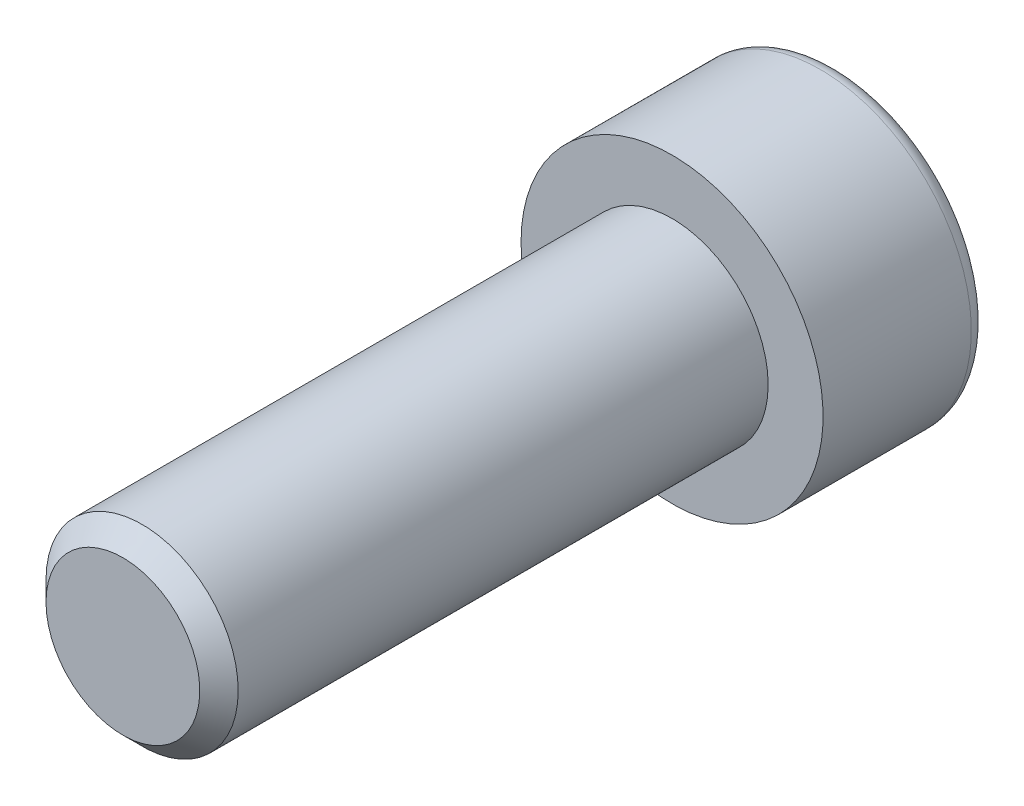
ISO-10303-21;
HEADER;
FILE_DESCRIPTION(('STEP AP214'),'2;1');
FILE_NAME('part.step','',(''),(''),'','','');
FILE_SCHEMA(('AUTOMOTIVE_DESIGN { 1 0 10303 214 1 1 1 1 }'));
ENDSEC;
DATA;
#1=APPLICATION_CONTEXT('core data for automotive mechanical design processes');
#2=APPLICATION_PROTOCOL_DEFINITION('international standard','automotive_design',2000,#1);
#3=PRODUCT_CONTEXT('',#1,'mechanical');
#4=PRODUCT('Part','Part','',(#3));
#5=PRODUCT_RELATED_PRODUCT_CATEGORY('part','',(#4));
#6=PRODUCT_DEFINITION_FORMATION('','',#4);
#7=PRODUCT_DEFINITION_CONTEXT('part definition',#1,'design');
#8=PRODUCT_DEFINITION('design','',#6,#7);
#9=PRODUCT_DEFINITION_SHAPE('','',#8);
#10=(LENGTH_UNIT() NAMED_UNIT(*) SI_UNIT(.MILLI.,.METRE.));
#11=(NAMED_UNIT(*) PLANE_ANGLE_UNIT() SI_UNIT($,.RADIAN.));
#12=(NAMED_UNIT(*) SI_UNIT($,.STERADIAN.) SOLID_ANGLE_UNIT());
#13=UNCERTAINTY_MEASURE_WITH_UNIT(LENGTH_MEASURE(1.E-05),#10,'distance_accuracy_value','');
#14=(GEOMETRIC_REPRESENTATION_CONTEXT(3) GLOBAL_UNCERTAINTY_ASSIGNED_CONTEXT((#13)) GLOBAL_UNIT_ASSIGNED_CONTEXT((#10,
#11,#12)) REPRESENTATION_CONTEXT('',''));
#15=CARTESIAN_POINT('',(0.,0.,0.));
#16=DIRECTION('',(0.,0.,1.));
#17=DIRECTION('',(1.,0.,0.));
#18=AXIS2_PLACEMENT_3D('',#15,#16,#17);
#19=CARTESIAN_POINT('',(0.,0.,-3.));
#20=DIRECTION('',(0.,0.,1.));
#21=DIRECTION('',(1.,0.,0.));
#22=AXIS2_PLACEMENT_3D('',#19,#20,#21);
#23=PLANE('',#22);
#24=CARTESIAN_POINT('',(0.,0.,-3.));
#25=DIRECTION('',(0.,0.,-1.));
#26=DIRECTION('',(-1.,0.,0.));
#27=AXIS2_PLACEMENT_3D('',#24,#25,#26);
#28=CIRCLE('',#27,2.45);
#29=CARTESIAN_POINT('',(-2.45,0.,-3.));
#30=VERTEX_POINT('',#29);
#31=EDGE_CURVE('E142',#30,#30,#28,.T.);
#32=ORIENTED_EDGE('',*,*,#31,.T.);
#33=EDGE_LOOP('',(#32));
#34=FACE_BOUND('',#33,.T.);
#35=DIRECTION('',(-0.86602540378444,0.499999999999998,0.));
#36=VECTOR('',#35,1.);
#37=CARTESIAN_POINT('',(0.,1.44337567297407,-3.));
#38=LINE('',#37,#36);
#39=CARTESIAN_POINT('',(1.25,0.721687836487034,-3.));
#40=VERTEX_POINT('',#39);
#41=CARTESIAN_POINT('',(0.,1.44337567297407,-3.));
#42=VERTEX_POINT('',#41);
#43=EDGE_CURVE('E46',#40,#42,#38,.T.);
#44=ORIENTED_EDGE('',*,*,#43,.T.);
#45=DIRECTION('',(-0.866025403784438,-0.500000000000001,0.));
#46=VECTOR('',#45,1.);
#47=CARTESIAN_POINT('',(0.,1.44337567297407,-3.));
#48=LINE('',#47,#46);
#49=CARTESIAN_POINT('',(-1.25,0.721687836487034,-3.));
#50=VERTEX_POINT('',#49);
#51=EDGE_CURVE('E86',#42,#50,#48,.T.);
#52=ORIENTED_EDGE('',*,*,#51,.T.);
#53=DIRECTION('',(0.,-1.,0.));
#54=VECTOR('',#53,1.);
#55=CARTESIAN_POINT('',(-1.25,-0.721687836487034,-3.));
#56=LINE('',#55,#54);
#57=CARTESIAN_POINT('',(-1.25,-0.721687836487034,-3.));
#58=VERTEX_POINT('',#57);
#59=EDGE_CURVE('E94',#50,#58,#56,.T.);
#60=ORIENTED_EDGE('',*,*,#59,.T.);
#61=DIRECTION('',(0.866025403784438,-0.500000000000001,0.));
#62=VECTOR('',#61,1.);
#63=CARTESIAN_POINT('',(0.,-1.44337567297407,-3.));
#64=LINE('',#63,#62);
#65=CARTESIAN_POINT('',(0.,-1.44337567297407,-3.));
#66=VERTEX_POINT('',#65);
#67=EDGE_CURVE('E112',#58,#66,#64,.T.);
#68=ORIENTED_EDGE('',*,*,#67,.T.);
#69=DIRECTION('',(0.86602540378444,0.499999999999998,0.));
#70=VECTOR('',#69,1.);
#71=CARTESIAN_POINT('',(0.,-1.44337567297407,-3.));
#72=LINE('',#71,#70);
#73=CARTESIAN_POINT('',(1.25,-0.721687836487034,-3.));
#74=VERTEX_POINT('',#73);
#75=EDGE_CURVE('E115',#66,#74,#72,.T.);
#76=ORIENTED_EDGE('',*,*,#75,.T.);
#77=DIRECTION('',(0.,1.,0.));
#78=VECTOR('',#77,1.);
#79=CARTESIAN_POINT('',(1.25,-0.721687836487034,-3.));
#80=LINE('',#79,#78);
#81=EDGE_CURVE('E105',#74,#40,#80,.T.);
#82=ORIENTED_EDGE('',*,*,#81,.T.);
#83=EDGE_LOOP('',(#44,#52,#60,#68,#76,#82));
#84=FACE_BOUND('',#83,.T.);
#85=ADVANCED_FACE('F32',(#34,#84),#23,.F.);
#86=CARTESIAN_POINT('',(0.,0.,-2.7));
#87=DIRECTION('',(0.,0.,-1.));
#88=DIRECTION('',(-1.,0.,0.));
#89=AXIS2_PLACEMENT_3D('',#86,#87,#88);
#90=TOROIDAL_SURFACE('',#89,2.45,0.3);
#91=ORIENTED_EDGE('',*,*,#31,.F.);
#92=EDGE_LOOP('',(#91));
#93=FACE_BOUND('',#92,.T.);
#94=CARTESIAN_POINT('',(0.,0.,-2.7));
#95=DIRECTION('',(0.,0.,-1.));
#96=DIRECTION('',(-1.,0.,0.));
#97=AXIS2_PLACEMENT_3D('',#94,#95,#96);
#98=CIRCLE('',#97,2.75);
#99=CARTESIAN_POINT('',(-2.75,0.,-2.7));
#100=VERTEX_POINT('',#99);
#101=EDGE_CURVE('E139',#100,#100,#98,.T.);
#102=ORIENTED_EDGE('',*,*,#101,.T.);
#103=EDGE_LOOP('',(#102));
#104=FACE_BOUND('',#103,.T.);
#105=ADVANCED_FACE('F161',(#93,#104),#90,.T.);
#106=CARTESIAN_POINT('',(0.,0.,0.));
#107=DIRECTION('',(0.,0.,-1.));
#108=DIRECTION('',(-1.,0.,0.));
#109=AXIS2_PLACEMENT_3D('',#106,#107,#108);
#110=CYLINDRICAL_SURFACE('',#109,2.75);
#111=ORIENTED_EDGE('',*,*,#101,.F.);
#112=EDGE_LOOP('',(#111));
#113=FACE_BOUND('',#112,.T.);
#114=CARTESIAN_POINT('',(0.,0.,0.));
#115=DIRECTION('',(0.,0.,-1.));
#116=DIRECTION('',(-1.,0.,0.));
#117=AXIS2_PLACEMENT_3D('',#114,#115,#116);
#118=CIRCLE('',#117,2.75);
#119=CARTESIAN_POINT('',(-2.75,0.,0.));
#120=VERTEX_POINT('',#119);
#121=EDGE_CURVE('E100',#120,#120,#118,.T.);
#122=ORIENTED_EDGE('',*,*,#121,.T.);
#123=EDGE_LOOP('',(#122));
#124=FACE_BOUND('',#123,.T.);
#125=ADVANCED_FACE('F166',(#113,#124),#110,.T.);
#126=CARTESIAN_POINT('',(0.,0.,0.));
#127=DIRECTION('',(0.,0.,-1.));
#128=DIRECTION('',(-1.,0.,0.));
#129=AXIS2_PLACEMENT_3D('',#126,#127,#128);
#130=PLANE('',#129);
#131=CARTESIAN_POINT('',(0.,0.,0.));
#132=DIRECTION('',(0.,0.,1.));
#133=DIRECTION('',(1.,0.,0.));
#134=AXIS2_PLACEMENT_3D('',#131,#132,#133);
#135=CIRCLE('',#134,1.75);
#136=CARTESIAN_POINT('',(1.75,0.,0.));
#137=VERTEX_POINT('',#136);
#138=EDGE_CURVE('E106',#137,#137,#135,.T.);
#139=ORIENTED_EDGE('',*,*,#138,.F.);
#140=EDGE_LOOP('',(#139));
#141=FACE_BOUND('',#140,.T.);
#142=ORIENTED_EDGE('',*,*,#121,.F.);
#143=EDGE_LOOP('',(#142));
#144=FACE_BOUND('',#143,.T.);
#145=ADVANCED_FACE('F174',(#141,#144),#130,.F.);
#146=CARTESIAN_POINT('',(0.,1.44337567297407,-1.7));
#147=DIRECTION('',(-0.499999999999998,-0.86602540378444,0.));
#148=DIRECTION('',(0.86602540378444,-0.499999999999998,0.));
#149=AXIS2_PLACEMENT_3D('',#146,#147,#148);
#150=PLANE('',#149);
#151=ORIENTED_EDGE('',*,*,#43,.F.);
#152=DIRECTION('',(0.,0.,-1.));
#153=VECTOR('',#152,1.);
#154=CARTESIAN_POINT('',(1.25,0.721687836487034,-1.7));
#155=LINE('',#154,#153);
#156=CARTESIAN_POINT('',(1.25,0.721687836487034,-1.7));
#157=VERTEX_POINT('',#156);
#158=EDGE_CURVE('E128',#157,#40,#155,.T.);
#159=ORIENTED_EDGE('',*,*,#158,.F.);
#160=DIRECTION('',(-0.86602540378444,0.499999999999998,0.));
#161=VECTOR('',#160,1.);
#162=CARTESIAN_POINT('',(0.,1.44337567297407,-1.7));
#163=LINE('',#162,#161);
#164=CARTESIAN_POINT('',(0.,1.44337567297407,-1.7));
#165=VERTEX_POINT('',#164);
#166=EDGE_CURVE('E99',#157,#165,#163,.T.);
#167=ORIENTED_EDGE('',*,*,#166,.T.);
#168=DIRECTION('',(0.,0.,-1.));
#169=VECTOR('',#168,1.);
#170=CARTESIAN_POINT('',(0.,1.44337567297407,-1.7));
#171=LINE('',#170,#169);
#172=EDGE_CURVE('E88',#165,#42,#171,.T.);
#173=ORIENTED_EDGE('',*,*,#172,.T.);
#174=EDGE_LOOP('',(#151,#159,#167,#173));
#175=FACE_BOUND('',#174,.T.);
#176=ADVANCED_FACE('F97',(#175),#150,.T.);
#177=CARTESIAN_POINT('',(0.,1.44337567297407,-1.7));
#178=DIRECTION('',(0.500000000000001,-0.866025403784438,0.));
#179=DIRECTION('',(0.866025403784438,0.500000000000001,0.));
#180=AXIS2_PLACEMENT_3D('',#177,#178,#179);
#181=PLANE('',#180);
#182=ORIENTED_EDGE('',*,*,#51,.F.);
#183=ORIENTED_EDGE('',*,*,#172,.F.);
#184=DIRECTION('',(-0.866025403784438,-0.500000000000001,0.));
#185=VECTOR('',#184,1.);
#186=CARTESIAN_POINT('',(0.,1.44337567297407,-1.7));
#187=LINE('',#186,#185);
#188=CARTESIAN_POINT('',(-1.25,0.721687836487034,-1.7));
#189=VERTEX_POINT('',#188);
#190=EDGE_CURVE('E119',#165,#189,#187,.T.);
#191=ORIENTED_EDGE('',*,*,#190,.T.);
#192=DIRECTION('',(0.,0.,-1.));
#193=VECTOR('',#192,1.);
#194=CARTESIAN_POINT('',(-1.25,0.721687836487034,-1.7));
#195=LINE('',#194,#193);
#196=EDGE_CURVE('E90',#189,#50,#195,.T.);
#197=ORIENTED_EDGE('',*,*,#196,.T.);
#198=EDGE_LOOP('',(#182,#183,#191,#197));
#199=FACE_BOUND('',#198,.T.);
#200=ADVANCED_FACE('F87',(#199),#181,.T.);
#201=CARTESIAN_POINT('',(-1.25,-0.721687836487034,-1.7));
#202=DIRECTION('',(1.,0.,0.));
#203=DIRECTION('',(0.,0.,-1.));
#204=AXIS2_PLACEMENT_3D('',#201,#202,#203);
#205=PLANE('',#204);
#206=ORIENTED_EDGE('',*,*,#59,.F.);
#207=ORIENTED_EDGE('',*,*,#196,.F.);
#208=DIRECTION('',(0.,-1.,0.));
#209=VECTOR('',#208,1.);
#210=CARTESIAN_POINT('',(-1.25,-0.721687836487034,-1.7));
#211=LINE('',#210,#209);
#212=CARTESIAN_POINT('',(-1.25,-0.721687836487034,-1.7));
#213=VERTEX_POINT('',#212);
#214=EDGE_CURVE('E121',#189,#213,#211,.T.);
#215=ORIENTED_EDGE('',*,*,#214,.T.);
#216=DIRECTION('',(0.,0.,-1.));
#217=VECTOR('',#216,1.);
#218=CARTESIAN_POINT('',(-1.25,-0.721687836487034,-1.7));
#219=LINE('',#218,#217);
#220=EDGE_CURVE('E134',#213,#58,#219,.T.);
#221=ORIENTED_EDGE('',*,*,#220,.T.);
#222=EDGE_LOOP('',(#206,#207,#215,#221));
#223=FACE_BOUND('',#222,.T.);
#224=ADVANCED_FACE('F189',(#223),#205,.T.);
#225=CARTESIAN_POINT('',(0.,-1.44337567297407,-1.7));
#226=DIRECTION('',(0.500000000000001,0.866025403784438,0.));
#227=DIRECTION('',(-0.866025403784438,0.500000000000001,0.));
#228=AXIS2_PLACEMENT_3D('',#225,#226,#227);
#229=PLANE('',#228);
#230=ORIENTED_EDGE('',*,*,#67,.F.);
#231=ORIENTED_EDGE('',*,*,#220,.F.);
#232=DIRECTION('',(0.866025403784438,-0.500000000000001,0.));
#233=VECTOR('',#232,1.);
#234=CARTESIAN_POINT('',(0.,-1.44337567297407,-1.7));
#235=LINE('',#234,#233);
#236=CARTESIAN_POINT('',(0.,-1.44337567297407,-1.7));
#237=VERTEX_POINT('',#236);
#238=EDGE_CURVE('E123',#213,#237,#235,.T.);
#239=ORIENTED_EDGE('',*,*,#238,.T.);
#240=DIRECTION('',(0.,0.,-1.));
#241=VECTOR('',#240,1.);
#242=CARTESIAN_POINT('',(0.,-1.44337567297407,-1.7));
#243=LINE('',#242,#241);
#244=EDGE_CURVE('E132',#237,#66,#243,.T.);
#245=ORIENTED_EDGE('',*,*,#244,.T.);
#246=EDGE_LOOP('',(#230,#231,#239,#245));
#247=FACE_BOUND('',#246,.T.);
#248=ADVANCED_FACE('F192',(#247),#229,.T.);
#249=CARTESIAN_POINT('',(0.,-1.44337567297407,-1.7));
#250=DIRECTION('',(-0.499999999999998,0.86602540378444,0.));
#251=DIRECTION('',(-0.86602540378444,-0.499999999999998,0.));
#252=AXIS2_PLACEMENT_3D('',#249,#250,#251);
#253=PLANE('',#252);
#254=ORIENTED_EDGE('',*,*,#75,.F.);
#255=ORIENTED_EDGE('',*,*,#244,.F.);
#256=DIRECTION('',(0.86602540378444,0.499999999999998,0.));
#257=VECTOR('',#256,1.);
#258=CARTESIAN_POINT('',(0.,-1.44337567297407,-1.7));
#259=LINE('',#258,#257);
#260=CARTESIAN_POINT('',(1.25,-0.721687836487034,-1.7));
#261=VERTEX_POINT('',#260);
#262=EDGE_CURVE('E125',#237,#261,#259,.T.);
#263=ORIENTED_EDGE('',*,*,#262,.T.);
#264=DIRECTION('',(0.,0.,-1.));
#265=VECTOR('',#264,1.);
#266=CARTESIAN_POINT('',(1.25,-0.721687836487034,-1.7));
#267=LINE('',#266,#265);
#268=EDGE_CURVE('E130',#261,#74,#267,.T.);
#269=ORIENTED_EDGE('',*,*,#268,.T.);
#270=EDGE_LOOP('',(#254,#255,#263,#269));
#271=FACE_BOUND('',#270,.T.);
#272=ADVANCED_FACE('F196',(#271),#253,.T.);
#273=CARTESIAN_POINT('',(1.25,-0.721687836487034,-1.7));
#274=DIRECTION('',(-1.,0.,0.));
#275=DIRECTION('',(0.,0.,1.));
#276=AXIS2_PLACEMENT_3D('',#273,#274,#275);
#277=PLANE('',#276);
#278=ORIENTED_EDGE('',*,*,#81,.F.);
#279=ORIENTED_EDGE('',*,*,#268,.F.);
#280=DIRECTION('',(0.,1.,0.));
#281=VECTOR('',#280,1.);
#282=CARTESIAN_POINT('',(1.25,-0.721687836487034,-1.7));
#283=LINE('',#282,#281);
#284=EDGE_CURVE('E53',#261,#157,#283,.T.);
#285=ORIENTED_EDGE('',*,*,#284,.T.);
#286=ORIENTED_EDGE('',*,*,#158,.T.);
#287=EDGE_LOOP('',(#278,#279,#285,#286));
#288=FACE_BOUND('',#287,.T.);
#289=ADVANCED_FACE('F200',(#288),#277,.T.);
#290=CARTESIAN_POINT('',(1.25,0.721687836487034,-1.7));
#291=DIRECTION('',(0.,0.,1.));
#292=DIRECTION('',(1.,0.,0.));
#293=AXIS2_PLACEMENT_3D('',#290,#291,#292);
#294=PLANE('',#293);
#295=ORIENTED_EDGE('',*,*,#166,.F.);
#296=ORIENTED_EDGE('',*,*,#284,.F.);
#297=ORIENTED_EDGE('',*,*,#262,.F.);
#298=ORIENTED_EDGE('',*,*,#238,.F.);
#299=ORIENTED_EDGE('',*,*,#214,.F.);
#300=ORIENTED_EDGE('',*,*,#190,.F.);
#301=EDGE_LOOP('',(#295,#296,#297,#298,#299,#300));
#302=FACE_BOUND('',#301,.T.);
#303=ADVANCED_FACE('F204',(#302),#294,.F.);
#304=CARTESIAN_POINT('',(0.,0.,10.));
#305=DIRECTION('',(0.,0.,1.));
#306=DIRECTION('',(1.,0.,0.));
#307=AXIS2_PLACEMENT_3D('',#304,#305,#306);
#308=PLANE('',#307);
#309=CARTESIAN_POINT('',(0.,0.,10.));
#310=DIRECTION('',(0.,0.,1.));
#311=DIRECTION('',(1.,0.,0.));
#312=AXIS2_PLACEMENT_3D('',#309,#310,#311);
#313=CIRCLE('',#312,1.4);
#314=CARTESIAN_POINT('',(-1.4,0.,10.));
#315=VERTEX_POINT('',#314);
#316=EDGE_CURVE('E39',#315,#315,#313,.T.);
#317=ORIENTED_EDGE('',*,*,#316,.T.);
#318=EDGE_LOOP('',(#317));
#319=FACE_BOUND('',#318,.T.);
#320=ADVANCED_FACE('F147',(#319),#308,.T.);
#321=CARTESIAN_POINT('',(0.,0.,0.));
#322=DIRECTION('',(0.,0.,1.));
#323=DIRECTION('',(1.,0.,0.));
#324=AXIS2_PLACEMENT_3D('',#321,#322,#323);
#325=CYLINDRICAL_SURFACE('',#324,1.75);
#326=CARTESIAN_POINT('',(0.,0.,9.65));
#327=DIRECTION('',(0.,0.,1.));
#328=DIRECTION('',(1.,0.,0.));
#329=AXIS2_PLACEMENT_3D('',#326,#327,#328);
#330=CIRCLE('',#329,1.75);
#331=CARTESIAN_POINT('',(-1.75,0.,9.65));
#332=VERTEX_POINT('',#331);
#333=EDGE_CURVE('E11',#332,#332,#330,.F.);
#334=ORIENTED_EDGE('',*,*,#333,.T.);
#335=EDGE_LOOP('',(#334));
#336=FACE_BOUND('',#335,.T.);
#337=ORIENTED_EDGE('',*,*,#138,.T.);
#338=EDGE_LOOP('',(#337));
#339=FACE_BOUND('',#338,.T.);
#340=ADVANCED_FACE('F151',(#336,#339),#325,.T.);
#341=CARTESIAN_POINT('',(0.,0.,10.));
#342=DIRECTION('',(0.,0.,-1.));
#343=DIRECTION('',(-1.,0.,0.));
#344=AXIS2_PLACEMENT_3D('',#341,#342,#343);
#345=CONICAL_SURFACE('',#344,1.4,0.785398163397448);
#346=CARTESIAN_POINT('',(-1.75,0.,9.65));
#347=CARTESIAN_POINT('',(-1.74635416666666,0.,9.65364583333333));
#348=CARTESIAN_POINT('',(-1.74270833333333,0.,9.65729166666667));
#349=CARTESIAN_POINT('',(-1.73541666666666,0.,9.66458333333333));
#350=CARTESIAN_POINT('',(-1.73177083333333,0.,9.66822916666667));
#351=CARTESIAN_POINT('',(-1.72447916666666,0.,9.67552083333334));
#352=CARTESIAN_POINT('',(-1.72083333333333,0.,9.67916666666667));
#353=CARTESIAN_POINT('',(-1.71354166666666,0.,9.68645833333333));
#354=CARTESIAN_POINT('',(-1.70989583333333,0.,9.69010416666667));
#355=CARTESIAN_POINT('',(-1.70260416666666,0.,9.69739583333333));
#356=CARTESIAN_POINT('',(-1.69895833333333,0.,9.70104166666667));
#357=CARTESIAN_POINT('',(-1.69166666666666,0.,9.70833333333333));
#358=CARTESIAN_POINT('',(-1.68802083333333,0.,9.71197916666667));
#359=CARTESIAN_POINT('',(-1.68072916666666,0.,9.71927083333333));
#360=CARTESIAN_POINT('',(-1.67708333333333,0.,9.72291666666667));
#361=CARTESIAN_POINT('',(-1.66979166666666,0.,9.73020833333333));
#362=CARTESIAN_POINT('',(-1.66614583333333,0.,9.73385416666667));
#363=CARTESIAN_POINT('',(-1.65885416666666,0.,9.74114583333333));
#364=CARTESIAN_POINT('',(-1.65520833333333,0.,9.74479166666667));
#365=CARTESIAN_POINT('',(-1.64791666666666,0.,9.75208333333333));
#366=CARTESIAN_POINT('',(-1.64427083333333,0.,9.75572916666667));
#367=CARTESIAN_POINT('',(-1.63697916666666,0.,9.76302083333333));
#368=CARTESIAN_POINT('',(-1.63333333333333,0.,9.76666666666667));
#369=CARTESIAN_POINT('',(-1.62604166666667,0.,9.77395833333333));
#370=CARTESIAN_POINT('',(-1.62239583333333,0.,9.77760416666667));
#371=CARTESIAN_POINT('',(-1.61510416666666,0.,9.78489583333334));
#372=CARTESIAN_POINT('',(-1.61145833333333,0.,9.78854166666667));
#373=CARTESIAN_POINT('',(-1.60416666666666,0.,9.79583333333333));
#374=CARTESIAN_POINT('',(-1.60052083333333,0.,9.79947916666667));
#375=CARTESIAN_POINT('',(-1.59322916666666,0.,9.80677083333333));
#376=CARTESIAN_POINT('',(-1.58958333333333,0.,9.81041666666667));
#377=CARTESIAN_POINT('',(-1.58229166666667,0.,9.81770833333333));
#378=CARTESIAN_POINT('',(-1.57864583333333,0.,9.82135416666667));
#379=CARTESIAN_POINT('',(-1.57135416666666,0.,9.82864583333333));
#380=CARTESIAN_POINT('',(-1.56770833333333,0.,9.83229166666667));
#381=CARTESIAN_POINT('',(-1.56041666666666,0.,9.83958333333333));
#382=CARTESIAN_POINT('',(-1.55677083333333,0.,9.84322916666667));
#383=CARTESIAN_POINT('',(-1.54947916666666,0.,9.85052083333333));
#384=CARTESIAN_POINT('',(-1.54583333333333,0.,9.85416666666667));
#385=CARTESIAN_POINT('',(-1.53854166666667,0.,9.86145833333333));
#386=CARTESIAN_POINT('',(-1.53489583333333,0.,9.86510416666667));
#387=CARTESIAN_POINT('',(-1.52760416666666,0.,9.87239583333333));
#388=CARTESIAN_POINT('',(-1.52395833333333,0.,9.87604166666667));
#389=CARTESIAN_POINT('',(-1.51666666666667,0.,9.88333333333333));
#390=CARTESIAN_POINT('',(-1.51302083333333,0.,9.88697916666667));
#391=CARTESIAN_POINT('',(-1.50572916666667,0.,9.89427083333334));
#392=CARTESIAN_POINT('',(-1.50208333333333,0.,9.89791666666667));
#393=CARTESIAN_POINT('',(-1.49479166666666,0.,9.90520833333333));
#394=CARTESIAN_POINT('',(-1.49114583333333,0.,9.90885416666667));
#395=CARTESIAN_POINT('',(-1.48385416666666,0.,9.91614583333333));
#396=CARTESIAN_POINT('',(-1.48020833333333,0.,9.91979166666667));
#397=CARTESIAN_POINT('',(-1.47291666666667,0.,9.92708333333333));
#398=CARTESIAN_POINT('',(-1.46927083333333,0.,9.93072916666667));
#399=CARTESIAN_POINT('',(-1.46197916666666,0.,9.93802083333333));
#400=CARTESIAN_POINT('',(-1.45833333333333,0.,9.94166666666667));
#401=CARTESIAN_POINT('',(-1.45104166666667,0.,9.94895833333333));
#402=CARTESIAN_POINT('',(-1.44739583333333,0.,9.95260416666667));
#403=CARTESIAN_POINT('',(-1.44010416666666,0.,9.95989583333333));
#404=CARTESIAN_POINT('',(-1.43645833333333,0.,9.96354166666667));
#405=CARTESIAN_POINT('',(-1.42916666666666,0.,9.97083333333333));
#406=CARTESIAN_POINT('',(-1.42552083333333,0.,9.97447916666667));
#407=CARTESIAN_POINT('',(-1.41822916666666,0.,9.98177083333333));
#408=CARTESIAN_POINT('',(-1.41458333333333,0.,9.98541666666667));
#409=CARTESIAN_POINT('',(-1.40729166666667,0.,9.99270833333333));
#410=CARTESIAN_POINT('',(-1.40364583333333,0.,9.99635416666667));
#411=CARTESIAN_POINT('',(-1.4,0.,10.));
#412=B_SPLINE_CURVE_WITH_KNOTS('',3,(#346,#347,#348,#349,#350,#351,#352,#353,#354,#355,#356,
#357,#358,#359,#360,#361,#362,#363,#364,#365,#366,#367,#368,#369,#370,#371,#372,#373,#374,#375,
#376,#377,#378,#379,#380,#381,#382,#383,#384,#385,#386,#387,#388,#389,#390,#391,#392,#393,#394,
#395,#396,#397,#398,#399,#400,#401,#402,#403,#404,#405,#406,#407,#408,#409,#410,#411),
.UNSPECIFIED.,.F.,.F.,(4,2,2,2,2,2,2,2,2,2,2,2,2,2,2,2,2,2,2,2,2,2,2,2,2,2,2,2,2,2,2,2,4),(0.,
0.0154679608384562,0.0309359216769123,0.0464038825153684,0.0618718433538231,0.0773398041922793,
0.0928077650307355,0.10827572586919,0.123743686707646,0.139211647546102,0.154679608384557,
0.170147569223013,0.18561553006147,0.201083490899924,0.216551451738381,0.232019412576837,
0.247487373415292,0.262955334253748,0.278423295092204,0.29389125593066,0.309359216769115,
0.324827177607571,0.340295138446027,0.355763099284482,0.371231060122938,0.386699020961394,
0.402166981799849,0.417634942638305,0.433102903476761,0.448570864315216,0.464038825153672,
0.479506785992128,0.494974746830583),.UNSPECIFIED.);
#413=EDGE_CURVE('BSEAM149',#332,#315,#412,.T.);
#414=ORIENTED_EDGE('',*,*,#333,.F.);
#415=ORIENTED_EDGE('',*,*,#316,.F.);
#416=ORIENTED_EDGE('',*,*,#413,.T.);
#417=ORIENTED_EDGE('',*,*,#413,.F.);
#418=EDGE_LOOP('',(#414,#416,#415,#417));
#419=FACE_BOUND('',#418,.T.);
#420=ADVANCED_FACE('F149',(#419),#345,.T.);
#421=CLOSED_SHELL('',(#85,#105,#125,#145,#176,#200,#224,#248,#272,#289,#303,#320,#340,#420));
#422=MANIFOLD_SOLID_BREP('B2',#421);
#423=ADVANCED_BREP_SHAPE_REPRESENTATION('',(#18,#422),#14);
#424=SHAPE_DEFINITION_REPRESENTATION(#9,#423);
ENDSEC;
END-ISO-10303-21;
